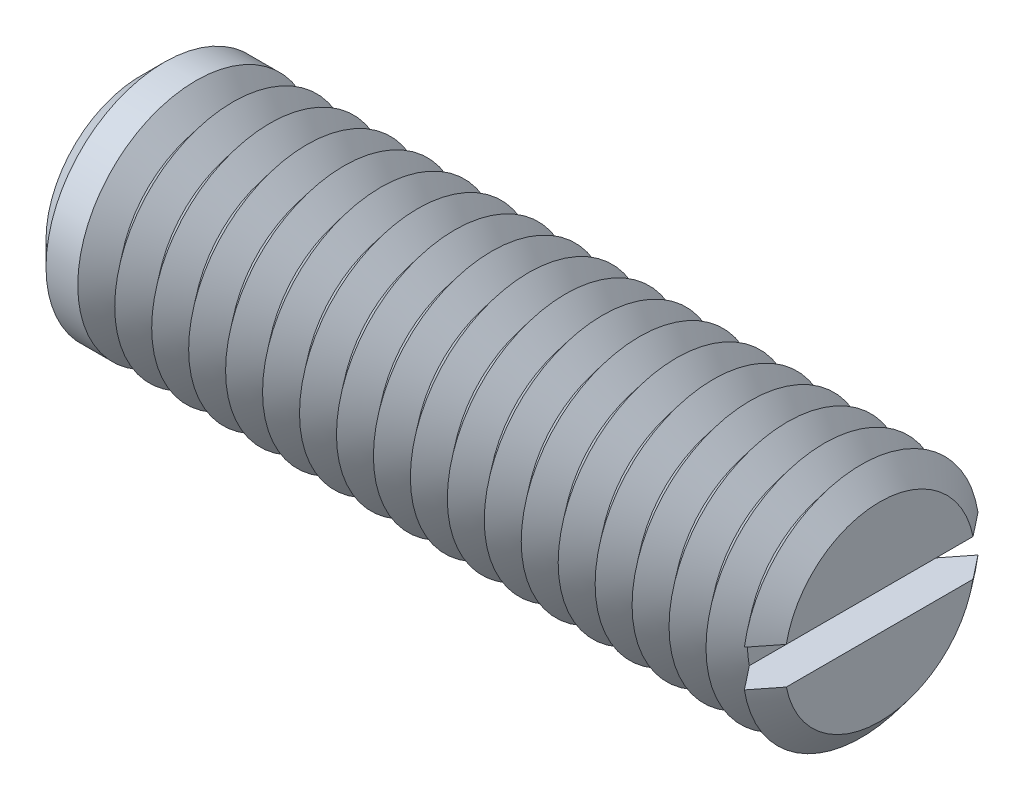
from build123d import *

# Parameters (mm, degrees)
SKETCH1_R       = 4
EXTRUDE1_DEPTH  = 12.5
SKETCH2_W       = 1.25
SKETCH2_H       = 1.25
EXTRUDE2_DEPTH  = 6
CHAMFER1_SIZE   = 0.8
LPATTERN1_COUNT = 19
LPATTERN1_PITCH = 1.25


with BuildPart() as part:
    # Sketch1 → Extrude1 (new, symmetric)
    with BuildSketch(Plane(origin=(0, 0, 0), x_dir=(0, 0, -1), z_dir=(1, 0, 0))):
        Circle(SKETCH1_R)
    extrude(amount=EXTRUDE1_DEPTH, both=True)

    # Sketch2 → Extrude2 (cut, symmetric)
    with BuildSketch(Plane.XY):
        with Locations((11.875, 0)):
            Rectangle(SKETCH2_W, SKETCH2_H)
    extrude(amount=EXTRUDE2_DEPTH, both=True, mode=Mode.SUBTRACT)

    # Chamfer1
    chamfer1_edges = [part.edges().sort_by_distance(p)[0] for p in [
        (-12.5, 0, 4),
    ]]
    chamfer(chamfer1_edges, length=CHAMFER1_SIZE)

    # Sketch3 → Cut-Revolve1 (revolve, cut)
    with BuildSketch(Plane.XY, mode=Mode.PRIVATE) as cut_revolve1_sk:
        Polygon((11.875, -4), (13.125, -4), (12.5, -3.21937525), align=None)
    cut_revolve1 = revolve(cut_revolve1_sk.sketch.rotate(Axis((0, 0, 0), (1, 0, 0)), 278.989299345), axis=Axis((0, 0, 0), (1, 0, 0)), mode=Mode.SUBTRACT)

    # LPattern1: Cut-Revolve1 ×19
    with Locations(*[(-i * LPATTERN1_PITCH, 0, 0) for i in range(1, LPATTERN1_COUNT)]):
        add(cut_revolve1, mode=Mode.SUBTRACT)


solid = part.part
